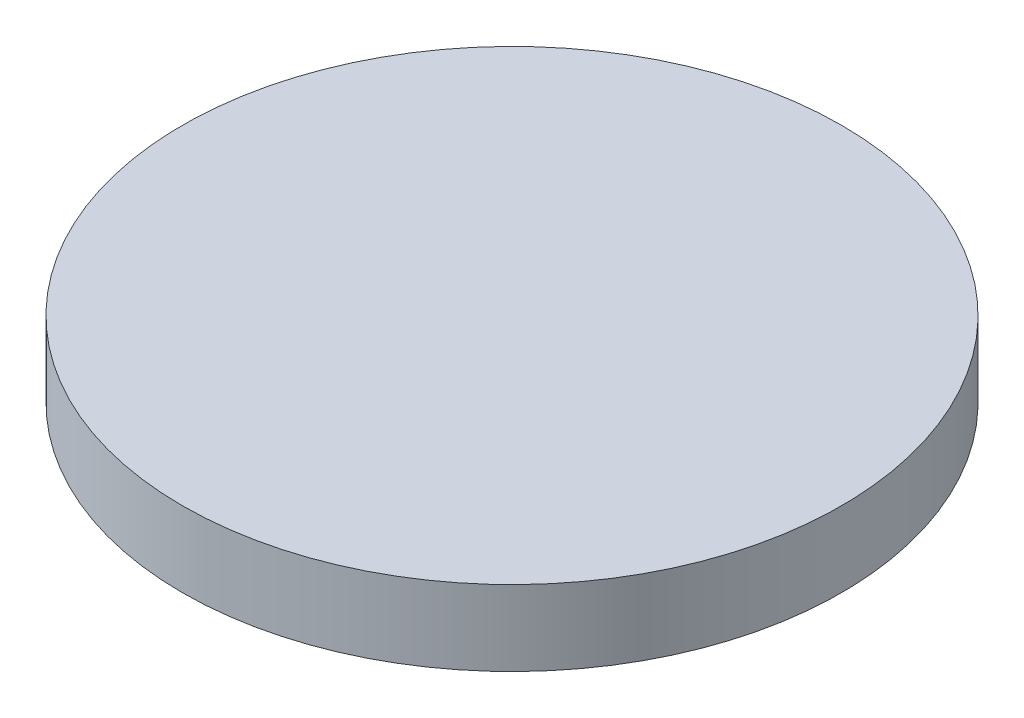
from build123d import *

# Parameters (mm, degrees)
SKETCH1_R           = 43.75
BOSS_EXTRUDE1_DEPTH = 10


with BuildPart() as part:
    # Sketch1 → Boss-Extrude1 (new body)
    with BuildSketch(Plane(origin=(0, 0, 0), x_dir=(1, 0, 0), z_dir=(0, 1, 0))):
        with Locations(Location((0, 0, 0), (0, 0, 270))):
            Circle(SKETCH1_R)
    extrude(amount=BOSS_EXTRUDE1_DEPTH)


solid = part.part
